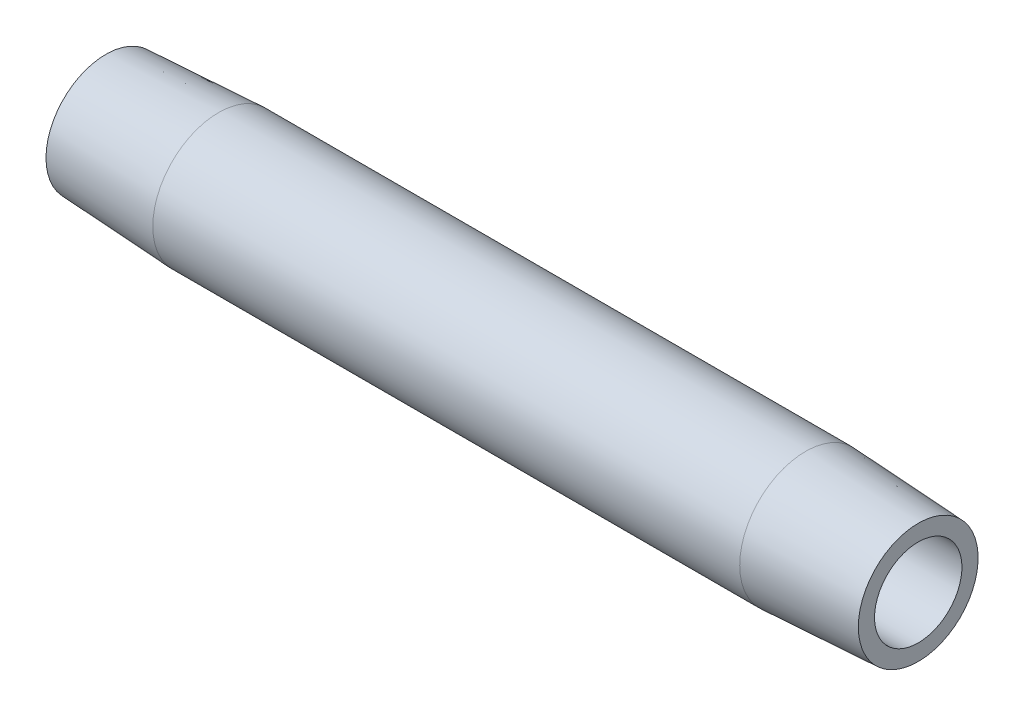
ISO-10303-21;
HEADER;
FILE_DESCRIPTION(('STEP AP214'),'2;1');
FILE_NAME('part.step','',(''),(''),'','','');
FILE_SCHEMA(('AUTOMOTIVE_DESIGN { 1 0 10303 214 1 1 1 1 }'));
ENDSEC;
DATA;
#1=APPLICATION_CONTEXT('core data for automotive mechanical design processes');
#2=APPLICATION_PROTOCOL_DEFINITION('international standard','automotive_design',2000,#1);
#3=PRODUCT_CONTEXT('',#1,'mechanical');
#4=PRODUCT('Part','Part','',(#3));
#5=PRODUCT_RELATED_PRODUCT_CATEGORY('part','',(#4));
#6=PRODUCT_DEFINITION_FORMATION('','',#4);
#7=PRODUCT_DEFINITION_CONTEXT('part definition',#1,'design');
#8=PRODUCT_DEFINITION('design','',#6,#7);
#9=PRODUCT_DEFINITION_SHAPE('','',#8);
#10=(LENGTH_UNIT() NAMED_UNIT(*) SI_UNIT(.MILLI.,.METRE.));
#11=(NAMED_UNIT(*) PLANE_ANGLE_UNIT() SI_UNIT($,.RADIAN.));
#12=(NAMED_UNIT(*) SI_UNIT($,.STERADIAN.) SOLID_ANGLE_UNIT());
#13=UNCERTAINTY_MEASURE_WITH_UNIT(LENGTH_MEASURE(1.E-05),#10,'distance_accuracy_value','');
#14=(GEOMETRIC_REPRESENTATION_CONTEXT(3) GLOBAL_UNCERTAINTY_ASSIGNED_CONTEXT((#13)) GLOBAL_UNIT_ASSIGNED_CONTEXT((#10,
#11,#12)) REPRESENTATION_CONTEXT('',''));
#15=CARTESIAN_POINT('',(0.,0.,0.));
#16=DIRECTION('',(0.,0.,1.));
#17=DIRECTION('',(1.,0.,0.));
#18=AXIS2_PLACEMENT_3D('',#15,#16,#17);
#19=CARTESIAN_POINT('',(0.476141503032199,0.,0.));
#20=DIRECTION('',(-1.,0.,0.));
#21=DIRECTION('',(0.,0.,1.));
#22=AXIS2_PLACEMENT_3D('',#19,#20,#21);
#23=CYLINDRICAL_SURFACE('',#22,5.14349999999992);
#24=CARTESIAN_POINT('',(8.8100393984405,0.,0.));
#25=DIRECTION('',(-1.,0.,0.));
#26=DIRECTION('',(0.,0.,1.));
#27=AXIS2_PLACEMENT_3D('',#24,#25,#26);
#28=CIRCLE('',#27,5.14349999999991);
#29=CARTESIAN_POINT('',(8.8100393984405,0.,5.14349999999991));
#30=VERTEX_POINT('',#29);
#31=EDGE_CURVE('E10',#30,#30,#28,.T.);
#32=ORIENTED_EDGE('',*,*,#31,.F.);
#33=EDGE_LOOP('',(#32));
#34=FACE_BOUND('',#33,.T.);
#35=CARTESIAN_POINT('',(54.6899606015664,0.,0.));
#36=DIRECTION('',(-1.,0.,0.));
#37=DIRECTION('',(0.,0.,1.));
#38=AXIS2_PLACEMENT_3D('',#35,#36,#37);
#39=CIRCLE('',#38,5.14349999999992);
#40=CARTESIAN_POINT('',(54.6899606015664,0.,5.14349999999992));
#41=VERTEX_POINT('',#40);
#42=EDGE_CURVE('E52',#41,#41,#39,.T.);
#43=ORIENTED_EDGE('',*,*,#42,.T.);
#44=EDGE_LOOP('',(#43));
#45=FACE_BOUND('',#44,.T.);
#46=ADVANCED_FACE('F30',(#34,#45),#23,.T.);
#47=CARTESIAN_POINT('',(8.8100393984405,0.,0.));
#48=DIRECTION('',(1.,0.,0.));
#49=DIRECTION('',(0.,0.,-1.));
#50=AXIS2_PLACEMENT_3D('',#47,#48,#49);
#51=CONICAL_SURFACE('',#50,5.14349999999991,0.0523598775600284);
#52=CARTESIAN_POINT('',(0.,0.,0.));
#53=DIRECTION('',(-1.,0.,0.));
#54=DIRECTION('',(0.,0.,1.));
#55=AXIS2_PLACEMENT_3D('',#52,#53,#54);
#56=CIRCLE('',#55,4.68178539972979);
#57=CARTESIAN_POINT('',(0.,0.,4.68178539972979));
#58=VERTEX_POINT('',#57);
#59=EDGE_CURVE('E36',#58,#58,#56,.T.);
#60=ORIENTED_EDGE('',*,*,#59,.F.);
#61=EDGE_LOOP('',(#60));
#62=FACE_BOUND('',#61,.T.);
#63=ORIENTED_EDGE('',*,*,#31,.T.);
#64=EDGE_LOOP('',(#63));
#65=FACE_BOUND('',#64,.T.);
#66=ADVANCED_FACE('F77',(#62,#65),#51,.T.);
#67=CARTESIAN_POINT('',(0.,4.68178539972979,0.));
#68=DIRECTION('',(1.,0.,0.));
#69=DIRECTION('',(0.,0.,-1.));
#70=AXIS2_PLACEMENT_3D('',#67,#68,#69);
#71=PLANE('',#70);
#72=CARTESIAN_POINT('',(0.,0.,0.));
#73=DIRECTION('',(-1.,0.,0.));
#74=DIRECTION('',(0.,0.,1.));
#75=AXIS2_PLACEMENT_3D('',#72,#73,#74);
#76=CIRCLE('',#75,3.4163);
#77=CARTESIAN_POINT('',(0.,0.,3.4163));
#78=VERTEX_POINT('',#77);
#79=EDGE_CURVE('E40',#78,#78,#76,.T.);
#80=ORIENTED_EDGE('',*,*,#79,.F.);
#81=EDGE_LOOP('',(#80));
#82=FACE_BOUND('',#81,.T.);
#83=ORIENTED_EDGE('',*,*,#59,.T.);
#84=EDGE_LOOP('',(#83));
#85=FACE_BOUND('',#84,.T.);
#86=ADVANCED_FACE('F72',(#82,#85),#71,.F.);
#87=CARTESIAN_POINT('',(0.476141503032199,0.,0.));
#88=DIRECTION('',(-1.,0.,0.));
#89=DIRECTION('',(0.,0.,1.));
#90=AXIS2_PLACEMENT_3D('',#87,#88,#89);
#91=CYLINDRICAL_SURFACE('',#90,3.4163);
#92=CARTESIAN_POINT('',(63.5,0.,0.));
#93=DIRECTION('',(-1.,0.,0.));
#94=DIRECTION('',(0.,0.,1.));
#95=AXIS2_PLACEMENT_3D('',#92,#93,#94);
#96=CIRCLE('',#95,3.41630000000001);
#97=CARTESIAN_POINT('',(63.5,0.,3.41630000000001));
#98=VERTEX_POINT('',#97);
#99=EDGE_CURVE('E44',#98,#98,#96,.T.);
#100=ORIENTED_EDGE('',*,*,#99,.F.);
#101=EDGE_LOOP('',(#100));
#102=FACE_BOUND('',#101,.T.);
#103=ORIENTED_EDGE('',*,*,#79,.T.);
#104=EDGE_LOOP('',(#103));
#105=FACE_BOUND('',#104,.T.);
#106=ADVANCED_FACE('F66',(#102,#105),#91,.F.);
#107=CARTESIAN_POINT('',(63.5,3.41630000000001,0.));
#108=DIRECTION('',(-1.,0.,0.));
#109=DIRECTION('',(0.,0.,1.));
#110=AXIS2_PLACEMENT_3D('',#107,#108,#109);
#111=PLANE('',#110);
#112=CARTESIAN_POINT('',(63.5,0.,0.));
#113=DIRECTION('',(-1.,0.,0.));
#114=DIRECTION('',(0.,0.,1.));
#115=AXIS2_PLACEMENT_3D('',#112,#113,#114);
#116=CIRCLE('',#115,4.68178539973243);
#117=CARTESIAN_POINT('',(63.5,0.,4.68178539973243));
#118=VERTEX_POINT('',#117);
#119=EDGE_CURVE('E49',#118,#118,#116,.T.);
#120=ORIENTED_EDGE('',*,*,#119,.F.);
#121=EDGE_LOOP('',(#120));
#122=FACE_BOUND('',#121,.T.);
#123=ORIENTED_EDGE('',*,*,#99,.T.);
#124=EDGE_LOOP('',(#123));
#125=FACE_BOUND('',#124,.T.);
#126=ADVANCED_FACE('F60',(#122,#125),#111,.F.);
#127=CARTESIAN_POINT('',(63.5,0.,0.));
#128=DIRECTION('',(-1.,0.,0.));
#129=DIRECTION('',(0.,0.,1.));
#130=AXIS2_PLACEMENT_3D('',#127,#128,#129);
#131=CONICAL_SURFACE('',#130,4.68178539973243,0.0523598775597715);
#132=ORIENTED_EDGE('',*,*,#42,.F.);
#133=EDGE_LOOP('',(#132));
#134=FACE_BOUND('',#133,.T.);
#135=ORIENTED_EDGE('',*,*,#119,.T.);
#136=EDGE_LOOP('',(#135));
#137=FACE_BOUND('',#136,.T.);
#138=ADVANCED_FACE('F57',(#134,#137),#131,.T.);
#139=CLOSED_SHELL('',(#46,#66,#86,#106,#126,#138));
#140=MANIFOLD_SOLID_BREP('B2',#139);
#141=ADVANCED_BREP_SHAPE_REPRESENTATION('',(#18,#140),#14);
#142=SHAPE_DEFINITION_REPRESENTATION(#9,#141);
ENDSEC;
END-ISO-10303-21;
